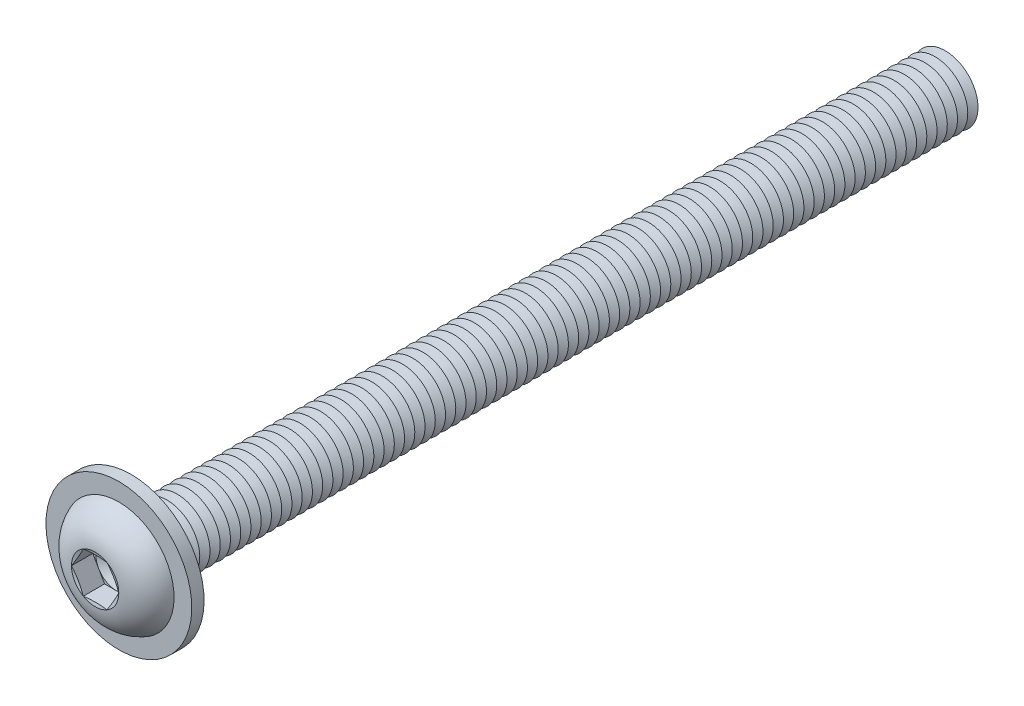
from build123d import *

# Parameters (mm, degrees)
FILLET1_R           = 0.625
LPATTERN1_COUNT     = 80
LPATTERN1_PITCH     = 1.25
CUT_EXTRUDE1_DEPTH  = 2.6
SKETCH5_R           = 8.9
SKETCH5_R_2         = 4.625
BOSS_EXTRUDE1_DEPTH = 1.5


with BuildPart() as part:
    # Sketch1 → Revolve1 (revolve)
    with BuildSketch(Plane(origin=(0, 0, 0), x_dir=(0, 0, -1), z_dir=(1, 0, 0))):
        with BuildLine():
            Line((0, 4), (0, 7))
            ThreePointArc((0, 7), (-3.011595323, 5.81154966), (-4.4, 2.88675))
            Line((-4.4, 2.88675), (-4.013248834, 1.443375))
            Line((-4.013248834, 1.443375), (-4.4, 1.443375))
            Line((-4.4, 1.443375), (-4.4, 0))
            Line((-4.4, 0), (100, 0))
            Line((100, 0), (100, 4))
            Line((100, 4), (0, 4))
        make_face()
    revolve(axis=Axis((0, 0, -100), (0, 0, 1)))

    # Fillet1
    fillet1_edges = [part.edges().sort_by_distance(p)[0] for p in [
        (0, -4, 0),
    ]]
    fillet(fillet1_edges, radius=FILLET1_R)

    # Sketch2 → Cut-Revolve1 (revolve, cut)
    with BuildSketch(Plane(origin=(0, 0, 0), x_dir=(0, 0, -1), z_dir=(1, 0, 0))):
        Polygon((99.375, 4), (100.625, 4), (100, 2.917468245), align=None)
    cut_revolve1 = revolve(axis=Axis((0, 0, -100), (0, 0, -1)), mode=Mode.SUBTRACT)

    # LPattern1: Cut-Revolve1 ×80
    with Locations(*[(0, 0, i * LPATTERN1_PITCH) for i in range(1, LPATTERN1_COUNT)]):
        add(cut_revolve1, mode=Mode.SUBTRACT)

    # Sketch3 → Cut-Extrude1 (cut)
    with BuildSketch(Plane.XY.offset(4.4)):
        Polygon((1.443375, 2.499998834), (-1.443375, 2.499998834), (-2.88675, 0), (-1.443375, -2.499998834), (1.443375, -2.499998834), (2.88675, 0), align=None)
    extrude(amount=-CUT_EXTRUDE1_DEPTH, mode=Mode.SUBTRACT)

    # Cut-Extrude2 cone 1 section (on through the dimple's axis) → Cut-Extrude2 (revolve, cut)
    with BuildSketch(Plane(origin=(0, 0, 1.8), x_dir=(0, -1, 0), z_dir=(1, 0, 0))):
        Polygon((0, 0), (2.499998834, 0), (0, 1.443375), align=None)
    revolve(axis=Axis((0, 0, 1.8), (0, 0, -1)), mode=Mode.SUBTRACT)

    # Sketch5 → Boss-Extrude1 (add)
    with BuildSketch(Plane(origin=(0, 0, 0), x_dir=(-1, 0, 0), z_dir=(0, 0, -1))):
        with Locations(Location((0, 0, 0), (0, 0, 90))):
            Circle(SKETCH5_R)
        Circle(SKETCH5_R_2, mode=Mode.SUBTRACT)
    extrude(amount=-BOSS_EXTRUDE1_DEPTH)


solid = part.part
